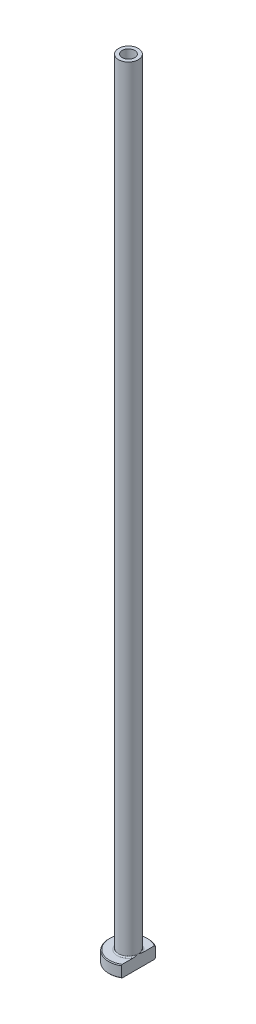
ISO-10303-21;
HEADER;
FILE_DESCRIPTION(('STEP AP214'),'2;1');
FILE_NAME('part.step','',(''),(''),'','','');
FILE_SCHEMA(('AUTOMOTIVE_DESIGN { 1 0 10303 214 1 1 1 1 }'));
ENDSEC;
DATA;
#1=APPLICATION_CONTEXT('core data for automotive mechanical design processes');
#2=APPLICATION_PROTOCOL_DEFINITION('international standard','automotive_design',2000,#1);
#3=PRODUCT_CONTEXT('',#1,'mechanical');
#4=PRODUCT('Part','Part','',(#3));
#5=PRODUCT_RELATED_PRODUCT_CATEGORY('part','',(#4));
#6=PRODUCT_DEFINITION_FORMATION('','',#4);
#7=PRODUCT_DEFINITION_CONTEXT('part definition',#1,'design');
#8=PRODUCT_DEFINITION('design','',#6,#7);
#9=PRODUCT_DEFINITION_SHAPE('','',#8);
#10=(LENGTH_UNIT() NAMED_UNIT(*) SI_UNIT(.MILLI.,.METRE.));
#11=(NAMED_UNIT(*) PLANE_ANGLE_UNIT() SI_UNIT($,.RADIAN.));
#12=(NAMED_UNIT(*) SI_UNIT($,.STERADIAN.) SOLID_ANGLE_UNIT());
#13=UNCERTAINTY_MEASURE_WITH_UNIT(LENGTH_MEASURE(1.E-05),#10,'distance_accuracy_value','');
#14=(GEOMETRIC_REPRESENTATION_CONTEXT(3) GLOBAL_UNCERTAINTY_ASSIGNED_CONTEXT((#13)) GLOBAL_UNIT_ASSIGNED_CONTEXT((#10,
#11,#12)) REPRESENTATION_CONTEXT('',''));
#15=CARTESIAN_POINT('',(0.,0.,0.));
#16=DIRECTION('',(0.,0.,1.));
#17=DIRECTION('',(1.,0.,0.));
#18=AXIS2_PLACEMENT_3D('',#15,#16,#17);
#19=CARTESIAN_POINT('',(0.,92.1876809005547,0.));
#20=DIRECTION('',(0.,1.,0.));
#21=DIRECTION('',(0.,0.,1.));
#22=AXIS2_PLACEMENT_3D('',#19,#20,#21);
#23=CYLINDRICAL_SURFACE('',#22,1.6);
#24=CARTESIAN_POINT('',(0.,200.,0.));
#25=DIRECTION('',(0.,1.,0.));
#26=DIRECTION('',(0.,0.,1.));
#27=AXIS2_PLACEMENT_3D('',#24,#25,#26);
#28=CIRCLE('',#27,1.6);
#29=CARTESIAN_POINT('',(0.,200.,1.6));
#30=VERTEX_POINT('',#29);
#31=EDGE_CURVE('E167',#30,#30,#28,.T.);
#32=ORIENTED_EDGE('',*,*,#31,.T.);
#33=EDGE_LOOP('',(#32));
#34=FACE_BOUND('',#33,.T.);
#35=CARTESIAN_POINT('',(0.,155.,0.));
#36=DIRECTION('',(0.,1.,0.));
#37=DIRECTION('',(0.,0.,1.));
#38=AXIS2_PLACEMENT_3D('',#35,#36,#37);
#39=CIRCLE('',#38,1.6);
#40=CARTESIAN_POINT('',(0.,155.,1.6));
#41=VERTEX_POINT('',#40);
#42=EDGE_CURVE('E170',#41,#41,#39,.T.);
#43=ORIENTED_EDGE('',*,*,#42,.F.);
#44=EDGE_LOOP('',(#43));
#45=FACE_BOUND('',#44,.T.);
#46=ADVANCED_FACE('F32',(#34,#45),#23,.F.);
#47=CARTESIAN_POINT('',(-1.6,200.,0.));
#48=DIRECTION('',(0.,1.,0.));
#49=DIRECTION('',(0.,0.,1.));
#50=AXIS2_PLACEMENT_3D('',#47,#48,#49);
#51=PLANE('',#50);
#52=CARTESIAN_POINT('',(0.,200.,0.));
#53=DIRECTION('',(0.,1.,0.));
#54=DIRECTION('',(0.,0.,1.));
#55=AXIS2_PLACEMENT_3D('',#52,#53,#54);
#56=CIRCLE('',#55,2.50000000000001);
#57=CARTESIAN_POINT('',(0.,200.,2.50000000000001));
#58=VERTEX_POINT('',#57);
#59=EDGE_CURVE('E174',#58,#58,#56,.T.);
#60=ORIENTED_EDGE('',*,*,#59,.T.);
#61=EDGE_LOOP('',(#60));
#62=FACE_BOUND('',#61,.T.);
#63=ORIENTED_EDGE('',*,*,#31,.F.);
#64=EDGE_LOOP('',(#63));
#65=FACE_BOUND('',#64,.T.);
#66=ADVANCED_FACE('F157',(#62,#65),#51,.T.);
#67=CARTESIAN_POINT('',(0.,92.1876809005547,0.));
#68=DIRECTION('',(0.,1.,0.));
#69=DIRECTION('',(0.,0.,1.));
#70=AXIS2_PLACEMENT_3D('',#67,#68,#69);
#71=CYLINDRICAL_SURFACE('',#70,2.5);
#72=CARTESIAN_POINT('',(0.,3.3,0.));
#73=DIRECTION('',(0.,1.,0.));
#74=DIRECTION('',(0.,0.,1.));
#75=AXIS2_PLACEMENT_3D('',#72,#73,#74);
#76=CIRCLE('',#75,2.5);
#77=CARTESIAN_POINT('',(2.5,3.3,0.));
#78=VERTEX_POINT('',#77);
#79=EDGE_CURVE('E180',#78,#78,#76,.T.);
#80=ORIENTED_EDGE('',*,*,#79,.T.);
#81=EDGE_LOOP('',(#80));
#82=FACE_BOUND('',#81,.T.);
#83=ORIENTED_EDGE('',*,*,#59,.F.);
#84=EDGE_LOOP('',(#83));
#85=FACE_BOUND('',#84,.T.);
#86=ADVANCED_FACE('F162',(#82,#85),#71,.T.);
#87=CARTESIAN_POINT('',(-2.49999999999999,3.,0.));
#88=DIRECTION('',(0.,1.,0.));
#89=DIRECTION('',(0.,0.,1.));
#90=AXIS2_PLACEMENT_3D('',#87,#88,#89);
#91=PLANE('',#90);
#92=DIRECTION('',(0.,0.,1.));
#93=VECTOR('',#92,1.);
#94=CARTESIAN_POINT('',(2.49999999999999,3.,0.));
#95=LINE('',#94,#93);
#96=CARTESIAN_POINT('',(2.49999999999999,3.,-4.09756024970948));
#97=VERTEX_POINT('',#96);
#98=CARTESIAN_POINT('',(2.49999999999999,3.,-1.26095202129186));
#99=VERTEX_POINT('',#98);
#100=EDGE_CURVE('E54',#97,#99,#95,.T.);
#101=ORIENTED_EDGE('',*,*,#100,.F.);
#102=CARTESIAN_POINT('',(0.,3.,0.));
#103=DIRECTION('',(0.,1.,0.));
#104=DIRECTION('',(0.,0.,1.));
#105=AXIS2_PLACEMENT_3D('',#102,#103,#104);
#106=CIRCLE('',#105,4.79999999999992);
#107=CARTESIAN_POINT('',(2.49999999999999,3.,4.09756024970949));
#108=VERTEX_POINT('',#107);
#109=EDGE_CURVE('E186',#97,#108,#106,.T.);
#110=ORIENTED_EDGE('',*,*,#109,.T.);
#111=CARTESIAN_POINT('',(2.49999999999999,3.,1.26095202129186));
#112=VERTEX_POINT('',#111);
#113=EDGE_CURVE('E134',#112,#108,#95,.T.);
#114=ORIENTED_EDGE('',*,*,#113,.F.);
#115=CARTESIAN_POINT('',(0.,3.,0.));
#116=DIRECTION('',(0.,1.,0.));
#117=DIRECTION('',(0.,0.,1.));
#118=AXIS2_PLACEMENT_3D('',#115,#116,#117);
#119=CIRCLE('',#118,2.8);
#120=EDGE_CURVE('E183',#112,#99,#119,.F.);
#121=ORIENTED_EDGE('',*,*,#120,.T.);
#122=EDGE_LOOP('',(#101,#110,#114,#121));
#123=FACE_BOUND('',#122,.T.);
#124=ADVANCED_FACE('F197',(#123),#91,.T.);
#125=CARTESIAN_POINT('',(0.,92.1876809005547,0.));
#126=DIRECTION('',(0.,1.,0.));
#127=DIRECTION('',(0.,0.,1.));
#128=AXIS2_PLACEMENT_3D('',#125,#126,#127);
#129=CYLINDRICAL_SURFACE('',#128,4.99999999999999);
#130=DIRECTION('',(0.,-1.,0.));
#131=VECTOR('',#130,1.);
#132=CARTESIAN_POINT('',(2.49999999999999,200.,4.33012701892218));
#133=LINE('',#132,#131);
#134=CARTESIAN_POINT('',(2.49999999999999,2.79999999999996,4.33012701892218));
#135=VERTEX_POINT('',#134);
#136=CARTESIAN_POINT('',(2.49999999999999,0.199999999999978,4.33012701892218));
#137=VERTEX_POINT('',#136);
#138=EDGE_CURVE('E82',#135,#137,#133,.T.);
#139=ORIENTED_EDGE('',*,*,#138,.F.);
#140=CARTESIAN_POINT('',(0.,2.79999999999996,0.));
#141=DIRECTION('',(0.,1.,0.));
#142=DIRECTION('',(0.,0.,1.));
#143=AXIS2_PLACEMENT_3D('',#140,#141,#142);
#144=CIRCLE('',#143,4.99999999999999);
#145=CARTESIAN_POINT('',(2.49999999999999,2.79999999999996,-4.33012701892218));
#146=VERTEX_POINT('',#145);
#147=EDGE_CURVE('E95',#135,#146,#144,.F.);
#148=ORIENTED_EDGE('',*,*,#147,.T.);
#149=DIRECTION('',(0.,-1.,0.));
#150=VECTOR('',#149,1.);
#151=CARTESIAN_POINT('',(2.49999999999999,200.,-4.33012701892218));
#152=LINE('',#151,#150);
#153=CARTESIAN_POINT('',(2.49999999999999,0.199999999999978,-4.33012701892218));
#154=VERTEX_POINT('',#153);
#155=EDGE_CURVE('E192',#146,#154,#152,.T.);
#156=ORIENTED_EDGE('',*,*,#155,.T.);
#157=CARTESIAN_POINT('',(0.,0.199999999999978,0.));
#158=DIRECTION('',(0.,-1.,0.));
#159=DIRECTION('',(0.,0.,-1.));
#160=AXIS2_PLACEMENT_3D('',#157,#158,#159);
#161=CIRCLE('',#160,4.99999999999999);
#162=EDGE_CURVE('E98',#154,#137,#161,.F.);
#163=ORIENTED_EDGE('',*,*,#162,.T.);
#164=EDGE_LOOP('',(#139,#148,#156,#163));
#165=FACE_BOUND('',#164,.T.);
#166=ADVANCED_FACE('F190',(#165),#129,.T.);
#167=CARTESIAN_POINT('',(-4.99999999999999,0.,0.));
#168=DIRECTION('',(0.,-1.,0.));
#169=DIRECTION('',(0.,0.,-1.));
#170=AXIS2_PLACEMENT_3D('',#167,#168,#169);
#171=PLANE('',#170);
#172=CARTESIAN_POINT('',(0.,0.,0.));
#173=DIRECTION('',(0.,-1.,0.));
#174=DIRECTION('',(0.,0.,-1.));
#175=AXIS2_PLACEMENT_3D('',#172,#173,#174);
#176=CIRCLE('',#175,2.35000000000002);
#177=CARTESIAN_POINT('',(0.,0.,-2.35000000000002));
#178=VERTEX_POINT('',#177);
#179=EDGE_CURVE('E40',#178,#178,#176,.F.);
#180=ORIENTED_EDGE('',*,*,#179,.T.);
#181=EDGE_LOOP('',(#180));
#182=FACE_BOUND('',#181,.T.);
#183=DIRECTION('',(0.,0.,-1.));
#184=VECTOR('',#183,1.);
#185=CARTESIAN_POINT('',(2.49999999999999,0.,4.33012701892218));
#186=LINE('',#185,#184);
#187=CARTESIAN_POINT('',(2.49999999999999,0.,4.09756024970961));
#188=VERTEX_POINT('',#187);
#189=CARTESIAN_POINT('',(2.5,0.,-4.09756024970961));
#190=VERTEX_POINT('',#189);
#191=EDGE_CURVE('E47',#188,#190,#186,.T.);
#192=ORIENTED_EDGE('',*,*,#191,.F.);
#193=CARTESIAN_POINT('',(0.,0.,0.));
#194=DIRECTION('',(0.,-1.,0.));
#195=DIRECTION('',(0.,0.,-1.));
#196=AXIS2_PLACEMENT_3D('',#193,#194,#195);
#197=CIRCLE('',#196,4.80000000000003);
#198=EDGE_CURVE('E92',#188,#190,#197,.T.);
#199=ORIENTED_EDGE('',*,*,#198,.T.);
#200=EDGE_LOOP('',(#192,#199));
#201=FACE_BOUND('',#200,.T.);
#202=ADVANCED_FACE('F91',(#182,#201),#171,.T.);
#203=CARTESIAN_POINT('',(0.,92.1876809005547,0.));
#204=DIRECTION('',(0.,1.,0.));
#205=DIRECTION('',(0.,0.,1.));
#206=AXIS2_PLACEMENT_3D('',#203,#204,#205);
#207=CYLINDRICAL_SURFACE('',#206,1.85);
#208=CARTESIAN_POINT('',(0.,0.500000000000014,0.));
#209=DIRECTION('',(0.,-1.,0.));
#210=DIRECTION('',(0.,0.,-1.));
#211=AXIS2_PLACEMENT_3D('',#208,#209,#210);
#212=CIRCLE('',#211,1.85);
#213=CARTESIAN_POINT('',(0.,0.500000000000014,-1.85));
#214=VERTEX_POINT('',#213);
#215=EDGE_CURVE('E11',#214,#214,#212,.T.);
#216=ORIENTED_EDGE('',*,*,#215,.T.);
#217=EDGE_LOOP('',(#216));
#218=FACE_BOUND('',#217,.T.);
#219=CARTESIAN_POINT('',(0.,143.,0.));
#220=DIRECTION('',(0.,1.,0.));
#221=DIRECTION('',(0.,0.,1.));
#222=AXIS2_PLACEMENT_3D('',#219,#220,#221);
#223=CIRCLE('',#222,1.85000000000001);
#224=CARTESIAN_POINT('',(0.,143.,1.85000000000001));
#225=VERTEX_POINT('',#224);
#226=EDGE_CURVE('E172',#225,#225,#223,.T.);
#227=ORIENTED_EDGE('',*,*,#226,.T.);
#228=EDGE_LOOP('',(#227));
#229=FACE_BOUND('',#228,.T.);
#230=ADVANCED_FACE('F215',(#218,#229),#207,.F.);
#231=CARTESIAN_POINT('',(0.,143.,0.));
#232=DIRECTION('',(0.,-1.,0.));
#233=DIRECTION('',(0.,0.,-1.));
#234=AXIS2_PLACEMENT_3D('',#231,#232,#233);
#235=CONICAL_SURFACE('',#234,1.85000000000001,0.0208303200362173);
#236=ORIENTED_EDGE('',*,*,#42,.T.);
#237=EDGE_LOOP('',(#236));
#238=FACE_BOUND('',#237,.T.);
#239=ORIENTED_EDGE('',*,*,#226,.F.);
#240=EDGE_LOOP('',(#239));
#241=FACE_BOUND('',#240,.T.);
#242=ADVANCED_FACE('F111',(#238,#241),#235,.F.);
#243=CARTESIAN_POINT('',(0.,3.3,0.));
#244=DIRECTION('',(0.,1.,0.));
#245=DIRECTION('',(0.,0.,1.));
#246=AXIS2_PLACEMENT_3D('',#243,#244,#245);
#247=TOROIDAL_SURFACE('',#246,2.8,0.3);
#248=ORIENTED_EDGE('',*,*,#120,.F.);
#249=CARTESIAN_POINT('',(2.5,3.3,0.));
#250=CARTESIAN_POINT('',(2.5,3.30000062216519,-4.84266590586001E-11));
#251=CARTESIAN_POINT('',(2.5,3.3000012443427,1.59621045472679E-07));
#252=CARTESIAN_POINT('',(2.5,3.30000243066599,6.45477951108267E-07));
#253=CARTESIAN_POINT('',(2.5,3.30000299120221,9.78480689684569E-07));
#254=CARTESIAN_POINT('',(2.5,3.30000411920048,1.77471979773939E-06));
#255=CARTESIAN_POINT('',(2.5,3.30000467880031,2.2490214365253E-06));
#256=CARTESIAN_POINT('',(2.5,3.30000572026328,3.25953681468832E-06));
#257=CARTESIAN_POINT('',(2.5,3.30000620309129,3.79480744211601E-06));
#258=CARTESIAN_POINT('',(2.5,3.30000787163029,5.75794640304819E-06));
#259=CARTESIAN_POINT('',(2.5,3.3000089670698,7.26424134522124E-06));
#260=CARTESIAN_POINT('',(2.5,3.30001087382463,1.03361133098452E-05));
#261=CARTESIAN_POINT('',(2.5,3.30001169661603,1.1894950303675E-05));
#262=CARTESIAN_POINT('',(2.5,3.30001489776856,1.81400858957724E-05));
#263=CARTESIAN_POINT('',(2.5,3.30001712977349,2.2906218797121E-05));
#264=CARTESIAN_POINT('',(2.5,3.30002067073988,3.2179387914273E-05));
#265=CARTESIAN_POINT('',(2.5,3.30002205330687,3.66589000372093E-05));
#266=CARTESIAN_POINT('',(2.5,3.30002810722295,5.6171842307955E-05));
#267=CARTESIAN_POINT('',(2.49999999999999,3.30003284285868,7.11735890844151E-05));
#268=CARTESIAN_POINT('',(2.49999999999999,3.30004025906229,9.89920358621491E-05));
#269=CARTESIAN_POINT('',(2.49999999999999,3.30004315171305,0.000111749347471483));
#270=CARTESIAN_POINT('',(2.5,3.30006652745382,0.000206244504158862));
#271=CARTESIAN_POINT('',(2.49999999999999,3.30009698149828,0.000285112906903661));
#272=CARTESIAN_POINT('',(2.49999999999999,3.30021213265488,0.00059446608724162));
#273=CARTESIAN_POINT('',(2.49999999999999,3.30028938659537,0.000826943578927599));
#274=CARTESIAN_POINT('',(2.5,3.30059681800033,0.00173885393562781));
#275=CARTESIAN_POINT('',(2.49999999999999,3.30083479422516,0.00241625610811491));
#276=CARTESIAN_POINT('',(2.49999999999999,3.301811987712,0.00521069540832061));
#277=CARTESIAN_POINT('',(2.49999999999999,3.30254240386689,0.00732996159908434));
#278=CARTESIAN_POINT('',(2.5,3.31226043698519,0.0355096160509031));
#279=CARTESIAN_POINT('',(2.5,3.32130808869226,0.0615551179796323));
#280=CARTESIAN_POINT('',(2.49999999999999,3.33896212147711,0.112677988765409));
#281=CARTESIAN_POINT('',(2.49999999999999,3.34757212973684,0.13775422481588));
#282=CARTESIAN_POINT('',(2.5,3.36573068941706,0.190981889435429));
#283=CARTESIAN_POINT('',(2.49999999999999,3.37526654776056,0.219137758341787));
#284=CARTESIAN_POINT('',(2.49999999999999,3.39422867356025,0.275816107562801));
#285=CARTESIAN_POINT('',(2.49999999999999,3.40365272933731,0.304339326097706));
#286=CARTESIAN_POINT('',(2.49999999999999,3.42641697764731,0.374416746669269));
#287=CARTESIAN_POINT('',(2.49999999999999,3.43959811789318,0.416023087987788));
#288=CARTESIAN_POINT('',(2.49999999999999,3.46479157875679,0.498481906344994));
#289=CARTESIAN_POINT('',(2.49999999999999,3.47682455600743,0.539328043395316));
#290=CARTESIAN_POINT('',(2.49999999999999,3.50224427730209,0.629981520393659));
#291=CARTESIAN_POINT('',(2.49999999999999,3.51538048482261,0.679860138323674));
#292=CARTESIAN_POINT('',(2.49999999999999,3.53964074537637,0.780511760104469));
#293=CARTESIAN_POINT('',(2.49999999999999,3.55074877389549,0.831288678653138));
#294=CARTESIAN_POINT('',(2.49999999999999,3.57087054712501,0.937063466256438));
#295=CARTESIAN_POINT('',(2.49999999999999,3.57967623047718,0.992102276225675));
#296=CARTESIAN_POINT('',(2.49999999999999,3.59301148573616,1.10256024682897));
#297=CARTESIAN_POINT('',(2.49999999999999,3.59755297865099,1.15797790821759));
#298=CARTESIAN_POINT('',(2.49999999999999,3.60093314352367,1.26786705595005));
#299=CARTESIAN_POINT('',(2.49999999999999,3.59989366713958,1.32233291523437));
#300=CARTESIAN_POINT('',(2.49999999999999,3.59277279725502,1.40310062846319));
#301=CARTESIAN_POINT('',(2.49999999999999,3.58952137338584,1.42965222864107));
#302=CARTESIAN_POINT('',(2.49999999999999,3.58085857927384,1.48239078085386));
#303=CARTESIAN_POINT('',(2.49999999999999,3.5754492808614,1.50857805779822));
#304=CARTESIAN_POINT('',(2.49999999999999,3.56298810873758,1.55658799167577));
#305=CARTESIAN_POINT('',(2.49999999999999,3.55628200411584,1.57849902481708));
#306=CARTESIAN_POINT('',(2.49999999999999,3.54055393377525,1.62160292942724));
#307=CARTESIAN_POINT('',(2.49999999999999,3.53152220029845,1.6427923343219));
#308=CARTESIAN_POINT('',(2.49999999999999,3.51057199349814,1.68404469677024));
#309=CARTESIAN_POINT('',(2.49999999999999,3.49862012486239,1.70409105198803));
#310=CARTESIAN_POINT('',(2.49999999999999,3.47134074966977,1.74172093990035));
#311=CARTESIAN_POINT('',(2.49999999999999,3.45603127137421,1.75931683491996));
#312=CARTESIAN_POINT('',(2.49999999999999,3.42979930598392,1.78297070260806));
#313=CARTESIAN_POINT('',(2.49999999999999,3.4202426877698,1.79054141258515));
#314=CARTESIAN_POINT('',(2.49999999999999,3.40009035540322,1.80416997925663));
#315=CARTESIAN_POINT('',(2.49999999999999,3.38949499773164,1.81022835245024));
#316=CARTESIAN_POINT('',(2.49999999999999,3.36727740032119,1.82047087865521));
#317=CARTESIAN_POINT('',(2.49999999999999,3.35564531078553,1.82463409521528));
#318=CARTESIAN_POINT('',(2.49999999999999,3.3317883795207,1.83058442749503));
#319=CARTESIAN_POINT('',(2.49999999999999,3.31956435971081,1.83237474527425));
#320=CARTESIAN_POINT('',(2.49999999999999,3.29665736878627,1.83331852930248));
#321=CARTESIAN_POINT('',(2.49999999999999,3.28598670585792,1.83279233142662));
#322=CARTESIAN_POINT('',(2.49999999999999,3.26490749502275,1.82986307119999));
#323=CARTESIAN_POINT('',(2.49999999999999,3.25449899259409,1.82745968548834));
#324=CARTESIAN_POINT('',(2.49999999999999,3.23467098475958,1.82111257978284));
#325=CARTESIAN_POINT('',(2.49999999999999,3.22522816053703,1.81724026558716));
#326=CARTESIAN_POINT('',(2.49999999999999,3.20699535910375,1.80819497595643));
#327=CARTESIAN_POINT('',(2.49999999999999,3.19820556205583,1.80302164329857));
#328=CARTESIAN_POINT('',(2.49999999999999,3.17663162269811,1.78842115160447));
#329=CARTESIAN_POINT('',(2.49999999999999,3.16436228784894,1.77823293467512));
#330=CARTESIAN_POINT('',(2.49999999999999,3.14157828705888,1.75604629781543));
#331=CARTESIAN_POINT('',(2.49999999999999,3.13106906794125,1.7440424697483));
#332=CARTESIAN_POINT('',(2.49999999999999,3.10600520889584,1.71142114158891));
#333=CARTESIAN_POINT('',(2.49999999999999,3.09267476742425,1.68986887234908));
#334=CARTESIAN_POINT('',(2.49999999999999,3.06940323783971,1.64508572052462));
#335=CARTESIAN_POINT('',(2.49999999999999,3.05946314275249,1.62185434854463));
#336=CARTESIAN_POINT('',(2.49999999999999,3.03545750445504,1.55546754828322));
#337=CARTESIAN_POINT('',(2.49999999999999,3.02444022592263,1.51122187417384));
#338=CARTESIAN_POINT('',(2.49999999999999,3.00863926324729,1.4211977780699));
#339=CARTESIAN_POINT('',(2.49999999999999,3.00393876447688,1.37540689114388));
#340=CARTESIAN_POINT('',(2.49999999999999,2.9992421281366,1.28072198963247));
#341=CARTESIAN_POINT('',(2.49999999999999,2.99956098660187,1.23181420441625));
#342=CARTESIAN_POINT('',(2.49999999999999,3.00436098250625,1.13410944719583));
#343=CARTESIAN_POINT('',(2.49999999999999,3.00885327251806,1.08531312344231));
#344=CARTESIAN_POINT('',(2.49999999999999,3.02074191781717,0.990773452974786));
#345=CARTESIAN_POINT('',(2.49999999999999,3.02796792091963,0.945007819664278));
#346=CARTESIAN_POINT('',(2.49999999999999,3.04465555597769,0.854199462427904));
#347=CARTESIAN_POINT('',(2.49999999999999,3.05410250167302,0.809153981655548));
#348=CARTESIAN_POINT('',(2.49999999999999,3.07710029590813,0.709411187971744));
#349=CARTESIAN_POINT('',(2.49999999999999,3.09109633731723,0.654817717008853));
#350=CARTESIAN_POINT('',(2.49999999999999,3.12140740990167,0.544863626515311));
#351=CARTESIAN_POINT('',(2.49999999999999,3.13777040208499,0.489516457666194));
#352=CARTESIAN_POINT('',(2.49999999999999,3.16649540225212,0.396740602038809));
#353=CARTESIAN_POINT('',(2.5,3.17848130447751,0.35919385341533));
#354=CARTESIAN_POINT('',(2.49999999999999,3.20280507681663,0.284651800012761));
#355=CARTESIAN_POINT('',(2.49999999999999,3.21513791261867,0.247654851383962));
#356=CARTESIAN_POINT('',(2.5,3.23873713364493,0.177767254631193));
#357=CARTESIAN_POINT('',(2.5,3.24997409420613,0.144866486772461));
#358=CARTESIAN_POINT('',(2.49999999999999,3.27307149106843,0.0777985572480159));
#359=CARTESIAN_POINT('',(2.49999999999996,3.28493883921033,0.0436336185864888));
#360=CARTESIAN_POINT('',(2.5,3.29745794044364,0.00732879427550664));
#361=CARTESIAN_POINT('',(2.5,3.29818879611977,0.00520838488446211));
#362=CARTESIAN_POINT('',(2.49999999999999,3.29916610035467,0.00241367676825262));
#363=CARTESIAN_POINT('',(2.49999999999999,3.29940376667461,0.00173715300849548));
#364=CARTESIAN_POINT('',(2.5,3.29971082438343,0.000826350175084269));
#365=CARTESIAN_POINT('',(2.5,3.29978800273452,0.000594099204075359));
#366=CARTESIAN_POINT('',(2.49999999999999,3.2999030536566,0.000285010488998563));
#367=CARTESIAN_POINT('',(2.49999999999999,3.29993349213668,0.000206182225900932));
#368=CARTESIAN_POINT('',(2.49999999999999,3.29995685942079,0.000111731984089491));
#369=CARTESIAN_POINT('',(2.5,3.29995975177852,9.89774347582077E-05));
#370=CARTESIAN_POINT('',(2.5,3.29996716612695,7.1165190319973E-05));
#371=CARTESIAN_POINT('',(2.5,3.29997189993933,5.6166810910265E-05));
#372=CARTESIAN_POINT('',(2.5,3.29997795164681,3.66576335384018E-05));
#373=CARTESIAN_POINT('',(2.5,3.2999793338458,3.21785252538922E-05));
#374=CARTESIAN_POINT('',(2.5,3.29998287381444,2.29061380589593E-05));
#375=CARTESIAN_POINT('',(2.5,3.29998510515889,1.81403664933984E-05));
#376=CARTESIAN_POINT('',(2.5,3.29998830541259,1.18955823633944E-05));
#377=CARTESIAN_POINT('',(2.5,3.29998912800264,1.0336776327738E-05));
#378=CARTESIAN_POINT('',(2.5,3.29999103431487,7.26492789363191E-06));
#379=CARTESIAN_POINT('',(2.5,3.29999212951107,5.75862280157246E-06));
#380=CARTESIAN_POINT('',(2.5,3.29999379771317,3.79542459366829E-06));
#381=CARTESIAN_POINT('',(2.5,3.29999428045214,3.26012752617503E-06));
#382=CARTESIAN_POINT('',(2.5,3.29999532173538,2.249543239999E-06));
#383=CARTESIAN_POINT('',(2.5,3.29999588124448,1.77519885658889E-06));
#384=CARTESIAN_POINT('',(2.5,3.29999700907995,9.78857024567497E-07));
#385=CARTESIAN_POINT('',(2.5,3.29999756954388,6.45796998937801E-07));
#386=CARTESIAN_POINT('',(2.5,3.29999875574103,1.5979958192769E-07));
#387=CARTESIAN_POINT('',(2.5,3.29999937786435,4.84248605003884E-11));
#388=CARTESIAN_POINT('',(2.5,3.3,0.));
#389=B_SPLINE_CURVE_WITH_KNOTS('',3,(#249,#250,#251,#252,#253,#254,#255,#256,#257,#258,#259,
#260,#261,#262,#263,#264,#265,#266,#267,#268,#269,#270,#271,#272,#273,#274,#275,#276,#277,#278,
#279,#280,#281,#282,#283,#284,#285,#286,#287,#288,#289,#290,#291,#292,#293,#294,#295,#296,#297,
#298,#299,#300,#301,#302,#303,#304,#305,#306,#307,#308,#309,#310,#311,#312,#313,#314,#315,#316,
#317,#318,#319,#320,#321,#322,#323,#324,#325,#326,#327,#328,#329,#330,#331,#332,#333,#334,#335,
#336,#337,#338,#339,#340,#341,#342,#343,#344,#345,#346,#347,#348,#349,#350,#351,#352,#353,#354,
#355,#356,#357,#358,#359,#360,#361,#362,#363,#364,#365,#366,#367,#368,#369,#370,#371,#372,#373,
#374,#375,#376,#377,#378,#379,#380,#381,#382,#383,#384,#385,#386,#387,#388),.UNSPECIFIED.,.T.,
.F.,(4,2,2,2,2,2,2,2,2,2,2,2,2,2,2,2,2,2,2,2,2,2,2,2,2,2,2,2,2,2,2,2,2,2,2,2,2,2,2,2,2,2,2,2,2,
2,2,2,2,2,2,2,2,2,2,2,2,2,2,2,2,2,2,2,2,2,2,2,2,4),(0.,1.86789206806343E-06,
3.81549562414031E-06,6.00610402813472E-06,8.16652880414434E-06,1.37285579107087E-05,
1.90122157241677E-05,3.47597277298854E-05,4.88082601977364E-05,9.59978438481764E-05,
0.000135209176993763,0.000388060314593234,0.00112364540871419,0.0032767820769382,
0.0100024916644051,0.0927120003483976,0.1722532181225,0.26143263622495,0.351551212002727,
0.482477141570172,0.610212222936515,0.764915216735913,0.920792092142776,1.08787897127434,
1.25449733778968,1.41749285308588,1.49767530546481,1.57778095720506,1.64642481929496,
1.71536183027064,1.78512750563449,1.85452737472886,1.89099315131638,1.92744645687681,
1.96429324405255,2.00109025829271,2.03297105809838,2.06485735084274,2.09535926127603,
2.12586955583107,2.17344034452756,2.22115572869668,2.29675134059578,2.37236907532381,
2.50839721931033,2.64619971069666,2.79268284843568,2.93955855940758,3.07848421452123,
3.21651583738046,3.38554045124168,3.5586593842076,3.67689643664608,3.79388863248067,
3.89819085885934,4.00668323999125,4.01341261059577,4.01556295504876,4.01629782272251,
4.01655054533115,4.01658974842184,4.01663692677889,4.0166509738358,4.0166667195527,
4.01667200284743,4.01667756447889,4.01667972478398,4.01668191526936,4.01668386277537,
4.01668573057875),.UNSPECIFIED.);
#390=EDGE_CURVE('E126',#112,#78,#389,.T.);
#391=ORIENTED_EDGE('',*,*,#390,.T.);
#392=ORIENTED_EDGE('',*,*,#79,.F.);
#393=CARTESIAN_POINT('',(2.5,3.3,0.));
#394=CARTESIAN_POINT('',(2.5,3.29999937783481,4.8426897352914E-11));
#395=CARTESIAN_POINT('',(2.5,3.29999875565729,-1.59621045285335E-07));
#396=CARTESIAN_POINT('',(2.5,3.29999756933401,-6.45477951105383E-07));
#397=CARTESIAN_POINT('',(2.5,3.29999700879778,-9.78480689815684E-07));
#398=CARTESIAN_POINT('',(2.5,3.29999588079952,-1.77471979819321E-06));
#399=CARTESIAN_POINT('',(2.5,3.29999532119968,-2.24902143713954E-06));
#400=CARTESIAN_POINT('',(2.5,3.29999427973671,-3.25953681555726E-06));
#401=CARTESIAN_POINT('',(2.5,3.2999937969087,-3.79480744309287E-06));
#402=CARTESIAN_POINT('',(2.5,3.2999921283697,-5.75794640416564E-06));
#403=CARTESIAN_POINT('',(2.5,3.29999103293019,-7.26424134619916E-06));
#404=CARTESIAN_POINT('',(2.5,3.29998912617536,-1.03361133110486E-05));
#405=CARTESIAN_POINT('',(2.5,3.29998830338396,-1.18949503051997E-05));
#406=CARTESIAN_POINT('',(2.5,3.29998510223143,-1.81400858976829E-05));
#407=CARTESIAN_POINT('',(2.5,3.29998287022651,-2.29062187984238E-05));
#408=CARTESIAN_POINT('',(2.5,3.29997932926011,-3.21793879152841E-05));
#409=CARTESIAN_POINT('',(2.5,3.29997794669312,-3.66589000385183E-05));
#410=CARTESIAN_POINT('',(2.5,3.29997189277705,-5.6171842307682E-05));
#411=CARTESIAN_POINT('',(2.5,3.29996715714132,-7.11735890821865E-05));
#412=CARTESIAN_POINT('',(2.5,3.2999597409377,-9.89920358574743E-05));
#413=CARTESIAN_POINT('',(2.49999999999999,3.29995684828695,-0.000111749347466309));
#414=CARTESIAN_POINT('',(2.49999999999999,3.29993347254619,-0.000206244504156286));
#415=CARTESIAN_POINT('',(2.49999999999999,3.29990301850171,-0.000285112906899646));
#416=CARTESIAN_POINT('',(2.5,3.29978786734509,-0.000594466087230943));
#417=CARTESIAN_POINT('',(2.5,3.29971061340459,-0.000826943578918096));
#418=CARTESIAN_POINT('',(2.49999999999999,3.29940318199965,-0.00173885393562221));
#419=CARTESIAN_POINT('',(2.49999999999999,3.29916520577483,-0.00241625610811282));
#420=CARTESIAN_POINT('',(2.5,3.29818801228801,-0.00521069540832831));
#421=CARTESIAN_POINT('',(2.5,3.29745759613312,-0.00732996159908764));
#422=CARTESIAN_POINT('',(2.49999999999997,3.28773956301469,-0.0355096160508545));
#423=CARTESIAN_POINT('',(2.49999999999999,3.2786919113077,-0.061555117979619));
#424=CARTESIAN_POINT('',(2.5,3.26103787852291,-0.11267798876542));
#425=CARTESIAN_POINT('',(2.5,3.25242787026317,-0.137754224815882));
#426=CARTESIAN_POINT('',(2.49999999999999,3.23426931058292,-0.190981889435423));
#427=CARTESIAN_POINT('',(2.49999999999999,3.22473345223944,-0.219137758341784));
#428=CARTESIAN_POINT('',(2.49999999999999,3.20577132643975,-0.275816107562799));
#429=CARTESIAN_POINT('',(2.49999999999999,3.19634727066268,-0.304339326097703));
#430=CARTESIAN_POINT('',(2.49999999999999,3.17358302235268,-0.374416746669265));
#431=CARTESIAN_POINT('',(2.49999999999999,3.16040188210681,-0.416023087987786));
#432=CARTESIAN_POINT('',(2.49999999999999,3.1352084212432,-0.498481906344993));
#433=CARTESIAN_POINT('',(2.49999999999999,3.12317544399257,-0.539328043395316));
#434=CARTESIAN_POINT('',(2.49999999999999,3.0977557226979,-0.629981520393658));
#435=CARTESIAN_POINT('',(2.49999999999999,3.08461951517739,-0.679860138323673));
#436=CARTESIAN_POINT('',(2.49999999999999,3.06035925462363,-0.780511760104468));
#437=CARTESIAN_POINT('',(2.49999999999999,3.0492512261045,-0.831288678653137));
#438=CARTESIAN_POINT('',(2.49999999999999,3.02912945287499,-0.937063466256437));
#439=CARTESIAN_POINT('',(2.49999999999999,3.02032376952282,-0.992102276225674));
#440=CARTESIAN_POINT('',(2.49999999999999,3.00698851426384,-1.10256024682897));
#441=CARTESIAN_POINT('',(2.49999999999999,3.002447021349,-1.15797790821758));
#442=CARTESIAN_POINT('',(2.49999999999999,2.99906685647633,-1.26786705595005));
#443=CARTESIAN_POINT('',(2.49999999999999,3.00010633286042,-1.32233291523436));
#444=CARTESIAN_POINT('',(2.49999999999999,3.00722720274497,-1.40310062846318));
#445=CARTESIAN_POINT('',(2.49999999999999,3.01047862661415,-1.42965222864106));
#446=CARTESIAN_POINT('',(2.49999999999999,3.01914142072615,-1.48239078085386));
#447=CARTESIAN_POINT('',(2.49999999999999,3.0245507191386,-1.50857805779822));
#448=CARTESIAN_POINT('',(2.49999999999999,3.03701189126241,-1.55658799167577));
#449=CARTESIAN_POINT('',(2.49999999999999,3.04371799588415,-1.57849902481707));
#450=CARTESIAN_POINT('',(2.49999999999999,3.05944606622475,-1.62160292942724));
#451=CARTESIAN_POINT('',(2.49999999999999,3.06847779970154,-1.64279233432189));
#452=CARTESIAN_POINT('',(2.49999999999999,3.08942800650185,-1.68404469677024));
#453=CARTESIAN_POINT('',(2.49999999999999,3.1013798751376,-1.70409105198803));
#454=CARTESIAN_POINT('',(2.49999999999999,3.12865925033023,-1.74172093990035));
#455=CARTESIAN_POINT('',(2.49999999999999,3.14396872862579,-1.75931683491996));
#456=CARTESIAN_POINT('',(2.49999999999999,3.17020069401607,-1.78297070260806));
#457=CARTESIAN_POINT('',(2.49999999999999,3.17975731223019,-1.79054141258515));
#458=CARTESIAN_POINT('',(2.49999999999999,3.19990964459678,-1.80416997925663));
#459=CARTESIAN_POINT('',(2.49999999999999,3.21050500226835,-1.81022835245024));
#460=CARTESIAN_POINT('',(2.49999999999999,3.2327225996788,-1.82047087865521));
#461=CARTESIAN_POINT('',(2.49999999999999,3.24435468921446,-1.82463409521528));
#462=CARTESIAN_POINT('',(2.49999999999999,3.2682116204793,-1.83058442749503));
#463=CARTESIAN_POINT('',(2.49999999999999,3.28043564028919,-1.83237474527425));
#464=CARTESIAN_POINT('',(2.49999999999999,3.30334263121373,-1.83331852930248));
#465=CARTESIAN_POINT('',(2.49999999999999,3.31401329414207,-1.83279233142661));
#466=CARTESIAN_POINT('',(2.49999999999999,3.33509250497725,-1.82986307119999));
#467=CARTESIAN_POINT('',(2.49999999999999,3.3455010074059,-1.82745968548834));
#468=CARTESIAN_POINT('',(2.49999999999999,3.36532901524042,-1.82111257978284));
#469=CARTESIAN_POINT('',(2.49999999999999,3.37477183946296,-1.81724026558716));
#470=CARTESIAN_POINT('',(2.49999999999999,3.39300464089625,-1.80819497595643));
#471=CARTESIAN_POINT('',(2.49999999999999,3.40179443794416,-1.80302164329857));
#472=CARTESIAN_POINT('',(2.49999999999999,3.42336837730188,-1.78842115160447));
#473=CARTESIAN_POINT('',(2.49999999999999,3.43563771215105,-1.77823293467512));
#474=CARTESIAN_POINT('',(2.49999999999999,3.45842171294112,-1.75604629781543));
#475=CARTESIAN_POINT('',(2.49999999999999,3.46893093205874,-1.7440424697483));
#476=CARTESIAN_POINT('',(2.49999999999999,3.49399479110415,-1.7114211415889));
#477=CARTESIAN_POINT('',(2.49999999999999,3.50732523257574,-1.68986887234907));
#478=CARTESIAN_POINT('',(2.49999999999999,3.53059676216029,-1.64508572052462));
#479=CARTESIAN_POINT('',(2.49999999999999,3.54053685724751,-1.62185434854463));
#480=CARTESIAN_POINT('',(2.49999999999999,3.56454249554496,-1.55546754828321));
#481=CARTESIAN_POINT('',(2.49999999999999,3.57555977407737,-1.51122187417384));
#482=CARTESIAN_POINT('',(2.49999999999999,3.5913607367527,-1.4211977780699));
#483=CARTESIAN_POINT('',(2.49999999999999,3.59606123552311,-1.37540689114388));
#484=CARTESIAN_POINT('',(2.49999999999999,3.6007578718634,-1.28072198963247));
#485=CARTESIAN_POINT('',(2.49999999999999,3.60043901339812,-1.23181420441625));
#486=CARTESIAN_POINT('',(2.49999999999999,3.59563901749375,-1.13410944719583));
#487=CARTESIAN_POINT('',(2.49999999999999,3.59114672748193,-1.0853131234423));
#488=CARTESIAN_POINT('',(2.49999999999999,3.57925808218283,-0.990773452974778));
#489=CARTESIAN_POINT('',(2.49999999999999,3.57203207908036,-0.945007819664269));
#490=CARTESIAN_POINT('',(2.49999999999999,3.5553444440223,-0.854199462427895));
#491=CARTESIAN_POINT('',(2.49999999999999,3.54589749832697,-0.809153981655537));
#492=CARTESIAN_POINT('',(2.49999999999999,3.52289970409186,-0.709411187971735));
#493=CARTESIAN_POINT('',(2.49999999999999,3.50890366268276,-0.654817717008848));
#494=CARTESIAN_POINT('',(2.49999999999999,3.47859259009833,-0.544863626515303));
#495=CARTESIAN_POINT('',(2.49999999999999,3.46222959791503,-0.489516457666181));
#496=CARTESIAN_POINT('',(2.49999999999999,3.43350459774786,-0.396740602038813));
#497=CARTESIAN_POINT('',(2.49999999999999,3.42151869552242,-0.359193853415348));
#498=CARTESIAN_POINT('',(2.49999999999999,3.39719492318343,-0.284651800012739));
#499=CARTESIAN_POINT('',(2.49999999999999,3.38486208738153,-0.247654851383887));
#500=CARTESIAN_POINT('',(2.5,3.36126286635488,-0.177767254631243));
#501=CARTESIAN_POINT('',(2.5,3.3500259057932,-0.144866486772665));
#502=CARTESIAN_POINT('',(2.49999999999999,3.32692850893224,-0.0777985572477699));
#503=CARTESIAN_POINT('',(2.49999999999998,3.31506116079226,-0.0436336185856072));
#504=CARTESIAN_POINT('',(2.5,3.3025420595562,-0.00732879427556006));
#505=CARTESIAN_POINT('',(2.5,3.30181120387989,-0.00520838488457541));
#506=CARTESIAN_POINT('',(2.49999999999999,3.30083389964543,-0.00241367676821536));
#507=CARTESIAN_POINT('',(2.49999999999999,3.30059623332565,-0.00173715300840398));
#508=CARTESIAN_POINT('',(2.49999999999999,3.30028917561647,-0.000826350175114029));
#509=CARTESIAN_POINT('',(2.5,3.30021199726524,-0.000594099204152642));
#510=CARTESIAN_POINT('',(2.49999999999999,3.30009694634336,-0.000285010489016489));
#511=CARTESIAN_POINT('',(2.49999999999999,3.30006650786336,-0.000206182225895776));
#512=CARTESIAN_POINT('',(2.49999999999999,3.30004314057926,-0.000111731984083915));
#513=CARTESIAN_POINT('',(2.49999999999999,3.30004024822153,-9.89774347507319E-05));
#514=CARTESIAN_POINT('',(2.5,3.30003283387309,-7.11651903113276E-05));
#515=CARTESIAN_POINT('',(2.5,3.3000281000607,-5.61668109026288E-05));
#516=CARTESIAN_POINT('',(2.5,3.30002204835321,-3.66576335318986E-05));
#517=CARTESIAN_POINT('',(2.5,3.30002066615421,-3.21785252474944E-05));
#518=CARTESIAN_POINT('',(2.5,3.30001712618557,-2.29061380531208E-05));
#519=CARTESIAN_POINT('',(2.5,3.30001489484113,-1.81403664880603E-05));
#520=CARTESIAN_POINT('',(2.5,3.30001169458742,-1.18955823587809E-05));
#521=CARTESIAN_POINT('',(2.5,3.30001087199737,-1.03367763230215E-05));
#522=CARTESIAN_POINT('',(2.5,3.30000896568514,-7.264927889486E-06));
#523=CARTESIAN_POINT('',(2.5,3.30000787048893,-5.75862279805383E-06));
#524=CARTESIAN_POINT('',(2.5,3.30000620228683,-3.79542459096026E-06));
#525=CARTESIAN_POINT('',(2.5,3.30000571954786,-3.26012752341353E-06));
#526=CARTESIAN_POINT('',(2.5,3.30000467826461,-2.24954323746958E-06));
#527=CARTESIAN_POINT('',(2.5,3.30000411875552,-1.7751988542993E-06));
#528=CARTESIAN_POINT('',(2.5,3.30000299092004,-9.78857022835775E-07));
#529=CARTESIAN_POINT('',(2.5,3.30000243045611,-6.45796997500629E-07));
#530=CARTESIAN_POINT('',(2.5,3.30000124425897,-1.597995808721E-07));
#531=CARTESIAN_POINT('',(2.5,3.30000062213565,-4.84240972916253E-11));
#532=CARTESIAN_POINT('',(2.5,3.3,0.));
#533=B_SPLINE_CURVE_WITH_KNOTS('',3,(#393,#394,#395,#396,#397,#398,#399,#400,#401,#402,#403,
#404,#405,#406,#407,#408,#409,#410,#411,#412,#413,#414,#415,#416,#417,#418,#419,#420,#421,#422,
#423,#424,#425,#426,#427,#428,#429,#430,#431,#432,#433,#434,#435,#436,#437,#438,#439,#440,#441,
#442,#443,#444,#445,#446,#447,#448,#449,#450,#451,#452,#453,#454,#455,#456,#457,#458,#459,#460,
#461,#462,#463,#464,#465,#466,#467,#468,#469,#470,#471,#472,#473,#474,#475,#476,#477,#478,#479,
#480,#481,#482,#483,#484,#485,#486,#487,#488,#489,#490,#491,#492,#493,#494,#495,#496,#497,#498,
#499,#500,#501,#502,#503,#504,#505,#506,#507,#508,#509,#510,#511,#512,#513,#514,#515,#516,#517,
#518,#519,#520,#521,#522,#523,#524,#525,#526,#527,#528,#529,#530,#531,#532),.UNSPECIFIED.,.T.,
.F.,(4,2,2,2,2,2,2,2,2,2,2,2,2,2,2,2,2,2,2,2,2,2,2,2,2,2,2,2,2,2,2,2,2,2,2,2,2,2,2,2,2,2,2,2,2,
2,2,2,2,2,2,2,2,2,2,2,2,2,2,2,2,2,2,2,2,2,2,2,2,4),(0.,1.86789206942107E-06,
3.81549562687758E-06,6.00610403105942E-06,8.16652880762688E-06,1.37285579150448E-05,
1.9012215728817E-05,3.47597277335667E-05,4.88082602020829E-05,9.59978438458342E-05,
0.000135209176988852,0.000388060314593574,0.00112364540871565,0.00327678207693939,
0.0100024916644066,0.0927120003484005,0.172253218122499,0.26143263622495,0.351551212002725,
0.482477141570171,0.610212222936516,0.764915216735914,0.920792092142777,1.08787897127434,
1.25449733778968,1.41749285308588,1.49767530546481,1.57778095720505,1.64642481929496,
1.71536183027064,1.78512750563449,1.85452737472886,1.89099315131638,1.92744645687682,
1.96429324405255,2.00109025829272,2.03297105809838,2.06485735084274,2.09535926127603,
2.12586955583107,2.17344034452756,2.22115572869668,2.29675134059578,2.37236907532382,
2.50839721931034,2.64619971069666,2.79268284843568,2.93955855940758,3.07848421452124,
3.21651583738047,3.38554045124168,3.55865938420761,3.67689643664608,3.79388863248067,
3.89819085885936,4.00668323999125,4.01341261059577,4.01556295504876,4.01629782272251,
4.01655054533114,4.01658974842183,4.01663692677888,4.0166509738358,4.0166667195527,
4.01667200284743,4.01667756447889,4.01667972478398,4.01668191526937,4.01668386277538,
4.01668573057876),.UNSPECIFIED.);
#534=EDGE_CURVE('E135',#78,#99,#533,.T.);
#535=ORIENTED_EDGE('',*,*,#534,.T.);
#536=EDGE_LOOP('',(#248,#391,#392,#535));
#537=FACE_BOUND('',#536,.T.);
#538=ADVANCED_FACE('F141',(#537),#247,.F.);
#539=CARTESIAN_POINT('',(0.,3.,0.));
#540=DIRECTION('',(0.,-1.,0.));
#541=DIRECTION('',(0.,0.,-1.));
#542=AXIS2_PLACEMENT_3D('',#539,#540,#541);
#543=CONICAL_SURFACE('',#542,4.79999999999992,0.785398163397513);
#544=CARTESIAN_POINT('',(2.5,-2.05039133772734,-9.52786489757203));
#545=CARTESIAN_POINT('',(2.5,-1.84160367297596,-9.31199733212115));
#546=CARTESIAN_POINT('',(2.5,-1.63304008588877,-9.09591231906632));
#547=CARTESIAN_POINT('',(2.5,-1.21649358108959,-8.66317810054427));
#548=CARTESIAN_POINT('',(2.5,-1.00851067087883,-8.44652888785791));
#549=CARTESIAN_POINT('',(2.5,-0.593157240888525,-8.01243155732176));
#550=CARTESIAN_POINT('',(2.5,-0.385787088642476,-7.79498308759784));
#551=CARTESIAN_POINT('',(2.5,0.0280365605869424,-7.35921771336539));
#552=CARTESIAN_POINT('',(2.5,0.234490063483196,-7.14090081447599));
#553=CARTESIAN_POINT('',(2.5,0.6421300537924,-6.70748960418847));
#554=CARTESIAN_POINT('',(2.49999999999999,0.843339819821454,-6.4924172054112));
#555=CARTESIAN_POINT('',(2.49999999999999,1.24425381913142,-6.06087422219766));
#556=CARTESIAN_POINT('',(2.49999999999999,1.44395806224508,-5.84440364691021));
#557=CARTESIAN_POINT('',(2.49999999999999,1.84127751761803,-5.40963663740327));
#558=CARTESIAN_POINT('',(2.49999999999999,2.0388931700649,-5.19134060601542));
#559=CARTESIAN_POINT('',(2.49999999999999,2.4312504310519,-4.75218509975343));
#560=CARTESIAN_POINT('',(2.49999999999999,2.62599215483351,-4.5313257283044));
#561=CARTESIAN_POINT('',(2.49999999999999,2.93693788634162,-4.17181619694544));
#562=CARTESIAN_POINT('',(2.49999999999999,3.05446493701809,-4.03431188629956));
#563=CARTESIAN_POINT('',(2.49999999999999,3.28742704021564,-3.75751486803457));
#564=CARTESIAN_POINT('',(2.49999999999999,3.40286188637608,-3.61822198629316));
#565=CARTESIAN_POINT('',(2.49999999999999,3.63213234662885,-3.33586492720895));
#566=CARTESIAN_POINT('',(2.49999999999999,3.74593818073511,-3.19277645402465));
#567=CARTESIAN_POINT('',(2.49999999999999,3.96956266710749,-2.90356071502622));
#568=CARTESIAN_POINT('',(2.49999999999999,4.07938227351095,-2.75743418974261));
#569=CARTESIAN_POINT('',(2.49999999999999,4.29502410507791,-2.45881038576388));
#570=CARTESIAN_POINT('',(2.49999999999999,4.40076032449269,-2.30625006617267));
#571=CARTESIAN_POINT('',(2.49999999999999,4.55286945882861,-2.07299325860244));
#572=CARTESIAN_POINT('',(2.49999999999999,4.60252613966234,-1.9944419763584));
#573=CARTESIAN_POINT('',(2.49999999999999,4.69908164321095,-1.83566827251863));
#574=CARTESIAN_POINT('',(2.49999999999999,4.74598077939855,-1.75544604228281));
#575=CARTESIAN_POINT('',(2.49999999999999,4.8357846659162,-1.59405362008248));
#576=CARTESIAN_POINT('',(2.49999999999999,4.87873126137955,-1.5129070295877));
#577=CARTESIAN_POINT('',(2.49999999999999,4.96038600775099,-1.34852090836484));
#578=CARTESIAN_POINT('',(2.49999999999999,4.99909338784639,-1.26528100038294));
#579=CARTESIAN_POINT('',(2.49999999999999,5.10703093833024,-1.01251774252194));
#580=CARTESIAN_POINT('',(2.49999999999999,5.16843307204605,-0.839342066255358));
#581=CARTESIAN_POINT('',(2.49999999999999,5.2349055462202,-0.579703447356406));
#582=CARTESIAN_POINT('',(2.49999999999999,5.25253806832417,-0.496421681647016));
#583=CARTESIAN_POINT('',(2.49999999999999,5.27986337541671,-0.328535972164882));
#584=CARTESIAN_POINT('',(2.49999999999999,5.28955686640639,-0.243932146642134));
#585=CARTESIAN_POINT('',(2.49999999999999,5.30031768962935,-0.0744340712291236));
#586=CARTESIAN_POINT('',(2.49999999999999,5.30141176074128,0.0104584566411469));
#587=CARTESIAN_POINT('',(2.49999999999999,5.29496530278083,0.179916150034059));
#588=CARTESIAN_POINT('',(2.49999999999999,5.28742406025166,0.264481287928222));
#589=CARTESIAN_POINT('',(2.49999999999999,5.26433424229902,0.431754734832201));
#590=CARTESIAN_POINT('',(2.49999999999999,5.24885436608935,0.514472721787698));
#591=CARTESIAN_POINT('',(2.49999999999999,5.21085318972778,0.678257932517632));
#592=CARTESIAN_POINT('',(2.49999999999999,5.18833104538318,0.759324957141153));
#593=CARTESIAN_POINT('',(2.49999999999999,5.1371892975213,0.920001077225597));
#594=CARTESIAN_POINT('',(2.49999999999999,5.10853534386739,0.999599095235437));
#595=CARTESIAN_POINT('',(2.49999999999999,5.04628092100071,1.15679278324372));
#596=CARTESIAN_POINT('',(2.49999999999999,5.01268146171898,1.23438885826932));
#597=CARTESIAN_POINT('',(2.49999999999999,4.90558195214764,1.46503672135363));
#598=CARTESIAN_POINT('',(2.49999999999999,4.8260156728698,1.61526350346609));
#599=CARTESIAN_POINT('',(2.49999999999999,4.65635232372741,1.90970759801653));
#600=CARTESIAN_POINT('',(2.49999999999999,4.56624199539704,2.0539170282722));
#601=CARTESIAN_POINT('',(2.49999999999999,4.37862201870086,2.33821627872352));
#602=CARTESIAN_POINT('',(2.49999999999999,4.2810846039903,2.47828761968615));
#603=CARTESIAN_POINT('',(2.49999999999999,4.08116271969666,2.75478641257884));
#604=CARTESIAN_POINT('',(2.49999999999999,3.97878070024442,2.891215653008));
#605=CARTESIAN_POINT('',(2.49999999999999,3.76913910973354,3.1631352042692));
#606=CARTESIAN_POINT('',(2.49999999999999,3.66183307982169,3.29858952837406));
#607=CARTESIAN_POINT('',(2.49999999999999,3.44456217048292,3.56736427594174));
#608=CARTESIAN_POINT('',(2.49999999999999,3.3345970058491,3.70068446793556));
#609=CARTESIAN_POINT('',(2.49999999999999,3.11293465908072,3.9653234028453));
#610=CARTESIAN_POINT('',(2.49999999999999,3.0012423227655,4.09664621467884));
#611=CARTESIAN_POINT('',(2.49999999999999,2.77631276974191,4.3579634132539));
#612=CARTESIAN_POINT('',(2.49999999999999,2.66307552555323,4.48795777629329));
#613=CARTESIAN_POINT('',(2.49999999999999,2.36028773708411,4.83228553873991));
#614=CARTESIAN_POINT('',(2.49999999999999,2.16967435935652,5.04568363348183));
#615=CARTESIAN_POINT('',(2.49999999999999,1.78611780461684,5.4703791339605));
#616=CARTESIAN_POINT('',(2.49999999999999,1.59317456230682,5.68167648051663));
#617=CARTESIAN_POINT('',(2.49999999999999,1.20540648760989,6.10290357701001));
#618=CARTESIAN_POINT('',(2.49999999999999,1.01058005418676,6.31283185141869));
#619=CARTESIAN_POINT('',(2.49999999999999,0.619649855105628,6.73149551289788));
#620=CARTESIAN_POINT('',(2.49999999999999,0.423546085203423,6.94023089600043));
#621=CARTESIAN_POINT('',(2.49999999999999,0.0384434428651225,7.34820392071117));
#622=CARTESIAN_POINT('',(2.49999999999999,-0.150515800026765,7.54747899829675));
#623=CARTESIAN_POINT('',(2.49999999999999,-0.529153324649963,7.9453460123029));
#624=CARTESIAN_POINT('',(2.49999999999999,-0.718831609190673,8.14393794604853));
#625=CARTESIAN_POINT('',(2.49999999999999,-1.09855461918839,8.54034636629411));
#626=CARTESIAN_POINT('',(2.49999999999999,-1.28859869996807,8.73816347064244));
#627=CARTESIAN_POINT('',(2.49999999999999,-1.66916268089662,9.13333639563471));
#628=CARTESIAN_POINT('',(2.49999999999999,-1.85968257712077,9.33069222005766));
#629=CARTESIAN_POINT('',(2.49999999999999,-2.05039133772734,9.52786489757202));
#630=B_SPLINE_CURVE_WITH_KNOTS('',3,(#544,#545,#546,#547,#548,#549,#550,#551,#552,#553,#554,
#555,#556,#557,#558,#559,#560,#561,#562,#563,#564,#565,#566,#567,#568,#569,#570,#571,#572,#573,
#574,#575,#576,#577,#578,#579,#580,#581,#582,#583,#584,#585,#586,#587,#588,#589,#590,#591,#592,
#593,#594,#595,#596,#597,#598,#599,#600,#601,#602,#603,#604,#605,#606,#607,#608,#609,#610,#611,
#612,#613,#614,#615,#616,#617,#618,#619,#620,#621,#622,#623,#624,#625,#626,#627,#628,#629),
.UNSPECIFIED.,.F.,.F.,(4,2,2,2,2,2,2,2,2,2,2,2,2,2,2,2,2,2,2,2,2,2,2,2,2,2,2,2,2,2,2,2,2,2,2,2,
2,2,2,2,2,2,4),(0.,0.900955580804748,1.80192274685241,2.70335062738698,3.60477268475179,
4.48832484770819,5.37187123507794,6.25522753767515,7.13854832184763,7.68119321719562,
8.22389134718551,8.77232299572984,9.32062249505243,9.87724663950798,10.1559936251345,
10.4347088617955,10.7100145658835,10.9853702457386,11.5339745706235,11.7890461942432,
12.0440951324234,12.2983507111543,12.5526272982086,12.8047396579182,13.0568822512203,
13.3104761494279,13.5640183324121,14.0732618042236,14.5831526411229,15.0950533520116,
15.6066978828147,16.1250759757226,16.6435099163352,17.1606868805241,17.6778730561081,
18.5362451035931,19.3946412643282,20.2538459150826,21.1130534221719,21.9369112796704,
22.7607723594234,23.5837145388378,24.4066499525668),.UNSPECIFIED.);
#631=EDGE_CURVE('E133',#146,#97,#630,.T.);
#632=ORIENTED_EDGE('',*,*,#631,.F.);
#633=ORIENTED_EDGE('',*,*,#147,.F.);
#634=EDGE_CURVE('E118',#108,#135,#630,.T.);
#635=ORIENTED_EDGE('',*,*,#634,.F.);
#636=ORIENTED_EDGE('',*,*,#109,.F.);
#637=EDGE_LOOP('',(#632,#633,#635,#636));
#638=FACE_BOUND('',#637,.T.);
#639=ADVANCED_FACE('F145',(#638),#543,.T.);
#640=CARTESIAN_POINT('',(0.,0.199999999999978,0.));
#641=DIRECTION('',(0.,1.,0.));
#642=DIRECTION('',(0.,0.,1.));
#643=AXIS2_PLACEMENT_3D('',#640,#641,#642);
#644=CONICAL_SURFACE('',#643,4.99999999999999,0.785398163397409);
#645=CARTESIAN_POINT('',(2.49999999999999,5.05039133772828,9.52786489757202));
#646=CARTESIAN_POINT('',(2.49999999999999,4.84160367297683,9.31199733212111));
#647=CARTESIAN_POINT('',(2.49999999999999,4.63304008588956,9.09591231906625));
#648=CARTESIAN_POINT('',(2.49999999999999,4.21649358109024,8.66317810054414));
#649=CARTESIAN_POINT('',(2.49999999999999,4.00851067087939,8.44652888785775));
#650=CARTESIAN_POINT('',(2.49999999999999,3.59315724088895,8.01243155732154));
#651=CARTESIAN_POINT('',(2.49999999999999,3.38578708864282,7.79498308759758));
#652=CARTESIAN_POINT('',(2.49999999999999,2.97196343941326,7.35921771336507));
#653=CARTESIAN_POINT('',(2.49999999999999,2.76550993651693,7.14090081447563));
#654=CARTESIAN_POINT('',(2.49999999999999,2.35786994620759,6.70748960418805));
#655=CARTESIAN_POINT('',(2.49999999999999,2.15666018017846,6.49241720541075));
#656=CARTESIAN_POINT('',(2.49999999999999,1.75574618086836,6.06087422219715));
#657=CARTESIAN_POINT('',(2.49999999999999,1.55604193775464,5.84440364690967));
#658=CARTESIAN_POINT('',(2.49999999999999,1.15872248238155,5.40963663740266));
#659=CARTESIAN_POINT('',(2.49999999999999,0.961106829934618,5.19134060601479));
#660=CARTESIAN_POINT('',(2.49999999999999,0.568749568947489,4.75218509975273));
#661=CARTESIAN_POINT('',(2.49999999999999,0.374007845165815,4.53132572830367));
#662=CARTESIAN_POINT('',(2.49999999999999,0.0630621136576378,4.17181619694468));
#663=CARTESIAN_POINT('',(2.49999999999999,-0.0544649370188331,4.03431188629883));
#664=CARTESIAN_POINT('',(2.49999999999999,-0.287427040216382,3.75751486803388));
#665=CARTESIAN_POINT('',(2.49999999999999,-0.402861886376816,3.6182219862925));
#666=CARTESIAN_POINT('',(2.49999999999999,-0.632132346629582,3.33586492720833));
#667=CARTESIAN_POINT('',(2.49999999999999,-0.745938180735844,3.19277645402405));
#668=CARTESIAN_POINT('',(2.49999999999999,-0.96956266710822,2.90356071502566));
#669=CARTESIAN_POINT('',(2.49999999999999,-1.07938227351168,2.75743418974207));
#670=CARTESIAN_POINT('',(2.49999999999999,-1.29502410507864,2.45881038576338));
#671=CARTESIAN_POINT('',(2.49999999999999,-1.40076032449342,2.30625006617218));
#672=CARTESIAN_POINT('',(2.49999999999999,-1.55286945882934,2.07299325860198));
#673=CARTESIAN_POINT('',(2.49999999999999,-1.60252613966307,1.99444197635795));
#674=CARTESIAN_POINT('',(2.49999999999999,-1.69908164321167,1.83566827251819));
#675=CARTESIAN_POINT('',(2.49999999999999,-1.74598077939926,1.75544604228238));
#676=CARTESIAN_POINT('',(2.49999999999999,-1.83578466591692,1.59405362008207));
#677=CARTESIAN_POINT('',(2.49999999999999,-1.87873126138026,1.51290702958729));
#678=CARTESIAN_POINT('',(2.49999999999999,-1.96038600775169,1.34852090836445));
#679=CARTESIAN_POINT('',(2.49999999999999,-1.99909338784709,1.26528100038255));
#680=CARTESIAN_POINT('',(2.49999999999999,-2.10703093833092,1.01251774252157));
#681=CARTESIAN_POINT('',(2.49999999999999,-2.16843307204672,0.839342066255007));
#682=CARTESIAN_POINT('',(2.49999999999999,-2.23490554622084,0.57970344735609));
#683=CARTESIAN_POINT('',(2.49999999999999,-2.25253806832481,0.496421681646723));
#684=CARTESIAN_POINT('',(2.49999999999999,-2.27986337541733,0.328535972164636));
#685=CARTESIAN_POINT('',(2.49999999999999,-2.289556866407,0.243932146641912));
#686=CARTESIAN_POINT('',(2.49999999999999,-2.30031768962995,0.0744340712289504));
#687=CARTESIAN_POINT('',(2.49999999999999,-2.30141176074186,-0.0104584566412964));
#688=CARTESIAN_POINT('',(2.49999999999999,-2.29496530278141,-0.17991615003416));
#689=CARTESIAN_POINT('',(2.49999999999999,-2.28742406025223,-0.264481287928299));
#690=CARTESIAN_POINT('',(2.49999999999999,-2.2643342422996,-0.431754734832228));
#691=CARTESIAN_POINT('',(2.49999999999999,-2.24885436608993,-0.514472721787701));
#692=CARTESIAN_POINT('',(2.49999999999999,-2.21085318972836,-0.678257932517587));
#693=CARTESIAN_POINT('',(2.49999999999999,-2.18833104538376,-0.759324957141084));
#694=CARTESIAN_POINT('',(2.49999999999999,-2.1371892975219,-0.920001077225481));
#695=CARTESIAN_POINT('',(2.49999999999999,-2.10853534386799,-0.999599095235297));
#696=CARTESIAN_POINT('',(2.49999999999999,-2.04628092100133,-1.15679278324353));
#697=CARTESIAN_POINT('',(2.49999999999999,-2.0126814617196,-1.2343888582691));
#698=CARTESIAN_POINT('',(2.49999999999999,-1.9055819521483,-1.46503672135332));
#699=CARTESIAN_POINT('',(2.49999999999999,-1.8260156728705,-1.61526350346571));
#700=CARTESIAN_POINT('',(2.49999999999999,-1.65635232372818,-1.909707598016));
#701=CARTESIAN_POINT('',(2.49999999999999,-1.56624199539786,-2.0539170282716));
#702=CARTESIAN_POINT('',(2.49999999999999,-1.37862201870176,-2.33821627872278));
#703=CARTESIAN_POINT('',(2.49999999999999,-1.28108460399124,-2.47828761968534));
#704=CARTESIAN_POINT('',(2.49999999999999,-1.08116271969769,-2.75478641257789));
#705=CARTESIAN_POINT('',(2.49999999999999,-0.978780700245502,-2.89121565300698));
#706=CARTESIAN_POINT('',(2.49999999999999,-0.769139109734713,-3.16313520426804));
#707=CARTESIAN_POINT('',(2.49999999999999,-0.661833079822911,-3.29858952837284));
#708=CARTESIAN_POINT('',(2.49999999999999,-0.444562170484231,-3.56736427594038));
#709=CARTESIAN_POINT('',(2.49999999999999,-0.334597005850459,-3.70068446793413));
#710=CARTESIAN_POINT('',(2.49999999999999,-0.112934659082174,-3.96532340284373));
#711=CARTESIAN_POINT('',(2.49999999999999,-0.00124232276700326,-4.09664621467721));
#712=CARTESIAN_POINT('',(2.49999999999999,0.223687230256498,-4.35796341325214));
#713=CARTESIAN_POINT('',(2.49999999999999,0.33692447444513,-4.48795777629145));
#714=CARTESIAN_POINT('',(2.49999999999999,0.639712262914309,-4.8322855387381));
#715=CARTESIAN_POINT('',(2.49999999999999,0.830325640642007,-5.04568363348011));
#716=CARTESIAN_POINT('',(2.49999999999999,1.21388219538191,-5.47037913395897));
#717=CARTESIAN_POINT('',(2.49999999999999,1.40682543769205,-5.68167648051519));
#718=CARTESIAN_POINT('',(2.49999999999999,1.79459351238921,-6.10290357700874));
#719=CARTESIAN_POINT('',(2.5,1.98941994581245,-6.31283185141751));
#720=CARTESIAN_POINT('',(2.5,2.38035014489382,-6.73149551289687));
#721=CARTESIAN_POINT('',(2.5,2.57645391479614,-6.94023089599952));
#722=CARTESIAN_POINT('',(2.5,2.96155655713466,-7.3482039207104));
#723=CARTESIAN_POINT('',(2.5,3.15051580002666,-7.54747899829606));
#724=CARTESIAN_POINT('',(2.5,3.52915332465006,-7.94534601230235));
#725=CARTESIAN_POINT('',(2.5,3.71883160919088,-8.14393794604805));
#726=CARTESIAN_POINT('',(2.5,4.0985546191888,-8.54034636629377));
#727=CARTESIAN_POINT('',(2.5,4.28859869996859,-8.73816347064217));
#728=CARTESIAN_POINT('',(2.5,4.66916268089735,-9.13333639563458));
#729=CARTESIAN_POINT('',(2.5,4.85968257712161,-9.33069222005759));
#730=CARTESIAN_POINT('',(2.5,5.05039133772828,-9.52786489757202));
#731=B_SPLINE_CURVE_WITH_KNOTS('',3,(#645,#646,#647,#648,#649,#650,#651,#652,#653,#654,#655,
#656,#657,#658,#659,#660,#661,#662,#663,#664,#665,#666,#667,#668,#669,#670,#671,#672,#673,#674,
#675,#676,#677,#678,#679,#680,#681,#682,#683,#684,#685,#686,#687,#688,#689,#690,#691,#692,#693,
#694,#695,#696,#697,#698,#699,#700,#701,#702,#703,#704,#705,#706,#707,#708,#709,#710,#711,#712,
#713,#714,#715,#716,#717,#718,#719,#720,#721,#722,#723,#724,#725,#726,#727,#728,#729,#730),
.UNSPECIFIED.,.F.,.F.,(4,2,2,2,2,2,2,2,2,2,2,2,2,2,2,2,2,2,2,2,2,2,2,2,2,2,2,2,2,2,2,2,2,2,2,2,
2,2,2,2,2,2,4),(0.,0.900955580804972,1.80192274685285,2.70335062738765,3.60477268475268,
4.48832484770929,5.37187123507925,6.25522753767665,7.13854832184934,7.68119321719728,
8.22389134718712,8.7723229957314,9.32062249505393,9.87724663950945,10.155993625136,
10.4347088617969,10.7100145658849,10.98537024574,11.5339745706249,11.7890461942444,
12.0440951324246,12.2983507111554,12.5526272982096,12.8047396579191,13.0568822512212,
13.3104761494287,13.5640183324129,14.0732618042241,14.5831526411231,15.0950533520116,
15.6066978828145,16.1250759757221,16.6435099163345,17.1606868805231,17.6778730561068,
18.5362451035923,19.3946412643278,20.2538459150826,21.1130534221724,21.9369112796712,
22.7607723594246,23.5837145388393,24.4066499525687),.UNSPECIFIED.);
#732=EDGE_CURVE('E79',#137,#188,#731,.T.);
#733=ORIENTED_EDGE('',*,*,#732,.F.);
#734=ORIENTED_EDGE('',*,*,#162,.F.);
#735=EDGE_CURVE('E87',#190,#154,#731,.T.);
#736=ORIENTED_EDGE('',*,*,#735,.F.);
#737=ORIENTED_EDGE('',*,*,#198,.F.);
#738=EDGE_LOOP('',(#733,#734,#736,#737));
#739=FACE_BOUND('',#738,.T.);
#740=ADVANCED_FACE('F94',(#739),#644,.T.);
#741=CARTESIAN_POINT('',(2.49999999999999,200.,4.33012701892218));
#742=DIRECTION('',(-1.,0.,0.));
#743=DIRECTION('',(0.,0.,1.));
#744=AXIS2_PLACEMENT_3D('',#741,#742,#743);
#745=PLANE('',#744);
#746=ORIENTED_EDGE('',*,*,#390,.F.);
#747=ORIENTED_EDGE('',*,*,#113,.T.);
#748=ORIENTED_EDGE('',*,*,#634,.T.);
#749=ORIENTED_EDGE('',*,*,#138,.T.);
#750=ORIENTED_EDGE('',*,*,#732,.T.);
#751=ORIENTED_EDGE('',*,*,#191,.T.);
#752=ORIENTED_EDGE('',*,*,#735,.T.);
#753=ORIENTED_EDGE('',*,*,#155,.F.);
#754=ORIENTED_EDGE('',*,*,#631,.T.);
#755=ORIENTED_EDGE('',*,*,#100,.T.);
#756=ORIENTED_EDGE('',*,*,#534,.F.);
#757=EDGE_LOOP('',(#746,#747,#748,#749,#750,#751,#752,#753,#754,#755,#756));
#758=FACE_BOUND('',#757,.T.);
#759=ADVANCED_FACE('F80',(#758),#745,.F.);
#760=CARTESIAN_POINT('',(0.,0.,0.));
#761=DIRECTION('',(0.,-1.,0.));
#762=DIRECTION('',(0.,0.,-1.));
#763=AXIS2_PLACEMENT_3D('',#760,#761,#762);
#764=CONICAL_SURFACE('',#763,2.35000000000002,0.785398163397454);
#765=ORIENTED_EDGE('',*,*,#215,.F.);
#766=EDGE_LOOP('',(#765));
#767=FACE_BOUND('',#766,.T.);
#768=ORIENTED_EDGE('',*,*,#179,.F.);
#769=EDGE_LOOP('',(#768));
#770=FACE_BOUND('',#769,.T.);
#771=ADVANCED_FACE('F34',(#767,#770),#764,.F.);
#772=CLOSED_SHELL('',(#46,#66,#86,#124,#166,#202,#230,#242,#538,#639,#740,#759,#771));
#773=MANIFOLD_SOLID_BREP('B2',#772);
#774=ADVANCED_BREP_SHAPE_REPRESENTATION('',(#18,#773),#14);
#775=SHAPE_DEFINITION_REPRESENTATION(#9,#774);
ENDSEC;
END-ISO-10303-21;
